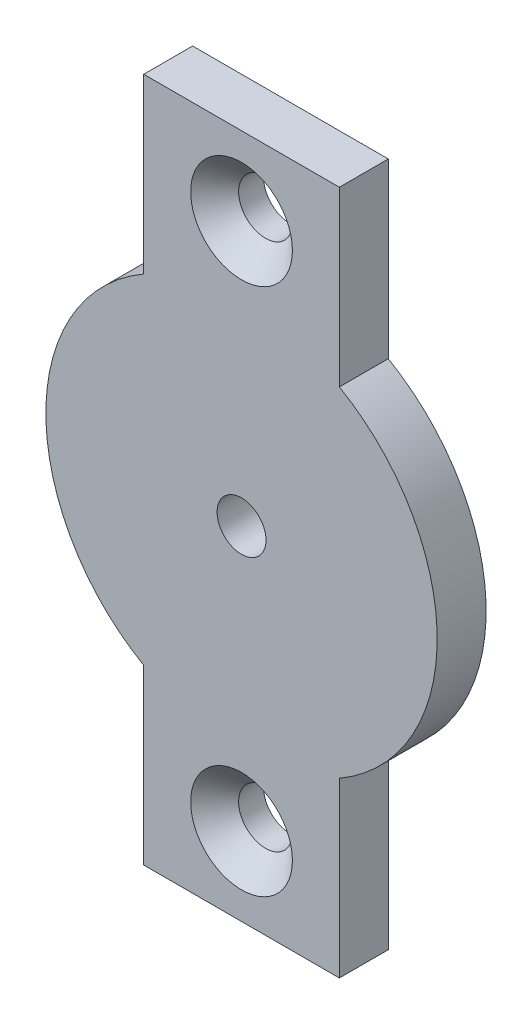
from build123d import *

# Parameters (mm, degrees)
SKETCH1_R                                           = 20
BOSS_EXTRUDE1_DEPTH                                 = 5
SKETCH2_W                                           = 20
SKETCH2_H                                           = 17.679491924
BOSS_EXTRUDE2_DEPTH                                 = 5
SKETCH3_R                                           = 2.5
CUT_EXTRUDE1_DEPTH                                  = 10
CSK_FOR_M5_COUNTERSUNK_FLAT_HEAD_SCREW1_D           = 5.5
CSK_FOR_M5_COUNTERSUNK_FLAT_HEAD_SCREW1_DEPTH       = 7
CSK_FOR_M5_COUNTERSUNK_FLAT_HEAD_SCREW1_CSINK_D     = 10.4
CSK_FOR_M5_COUNTERSUNK_FLAT_HEAD_SCREW1_CSINK_ANGLE = 90
CSK_FOR_M5_COUNTERSUNK_FLAT_HEAD_SCREW1_TIP         = 1.652366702


with BuildPart() as part:
    # Sketch1 → Boss-Extrude1 (new body)
    with BuildSketch(Plane.XY):
        Circle(SKETCH1_R)
    extrude(amount=BOSS_EXTRUDE1_DEPTH)

    # Sketch2 → Boss-Extrude2 (add)
    with BuildSketch(Plane.XY.offset(5)):
        with Locations((0, 26.160254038)):
            Rectangle(SKETCH2_W, SKETCH2_H)
    boss_extrude2 = extrude(amount=-BOSS_EXTRUDE2_DEPTH)

    # Mirror1: Boss-Extrude2 across plane
    add(boss_extrude2.mirror(Plane.ZX))

    # Sketch3 → Cut-Extrude1 (cut)
    with BuildSketch(Plane.XY.offset(5)):
        Circle(SKETCH3_R)
    extrude(amount=-CUT_EXTRUDE1_DEPTH, mode=Mode.SUBTRACT)

    # CSK for M5 Countersunk Flat Head Screw1
    with Locations(Plane(origin=(0, -27, 5), x_dir=(1, 0, 0), z_dir=(0, 0, 1))):
        with Locations((0, 0), (0, 54)):
            CounterSinkHole(CSK_FOR_M5_COUNTERSUNK_FLAT_HEAD_SCREW1_D / 2, CSK_FOR_M5_COUNTERSUNK_FLAT_HEAD_SCREW1_CSINK_D / 2, depth=CSK_FOR_M5_COUNTERSUNK_FLAT_HEAD_SCREW1_DEPTH, counter_sink_angle=CSK_FOR_M5_COUNTERSUNK_FLAT_HEAD_SCREW1_CSINK_ANGLE)
            with Locations((0, 0, -(CSK_FOR_M5_COUNTERSUNK_FLAT_HEAD_SCREW1_DEPTH + CSK_FOR_M5_COUNTERSUNK_FLAT_HEAD_SCREW1_TIP / 2))):  # 118° drill point
                Cone(0, CSK_FOR_M5_COUNTERSUNK_FLAT_HEAD_SCREW1_D / 2, CSK_FOR_M5_COUNTERSUNK_FLAT_HEAD_SCREW1_TIP, mode=Mode.SUBTRACT)


solid = part.part
